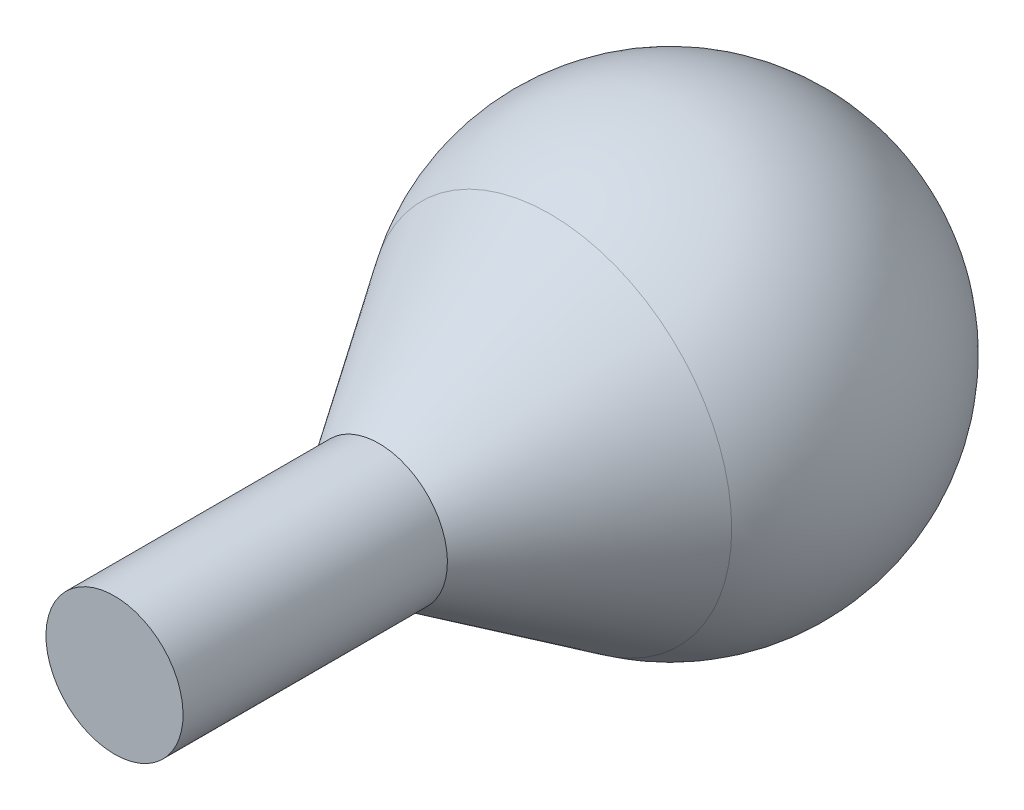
from build123d import *


with BuildPart() as part:
    # Esquisse1 → R_volution1 (revolve)
    with BuildSketch(Plane(origin=(0, 0, 0), x_dir=(0, 0, -1), z_dir=(1, 0, 0)), mode=Mode.PRIVATE) as r_volution1_sk:
        with BuildLine():
            Line((0, 0), (27, 0))
            Line((27, 0), (44.475891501, 11.558253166))
            ThreePointArc((44.475891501, 11.558253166), (67.284789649, 12.597977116), (79, -7))
            Line((79, -7), (0, -7))
            Line((0, -7), (0, 0))
        make_face()
    revolve(r_volution1_sk.sketch.rotate(Axis((0, -7, 0), (0, 0, -1)), 180), axis=Axis((0, -7, 0), (0, 0, -1)))


solid = part.part
